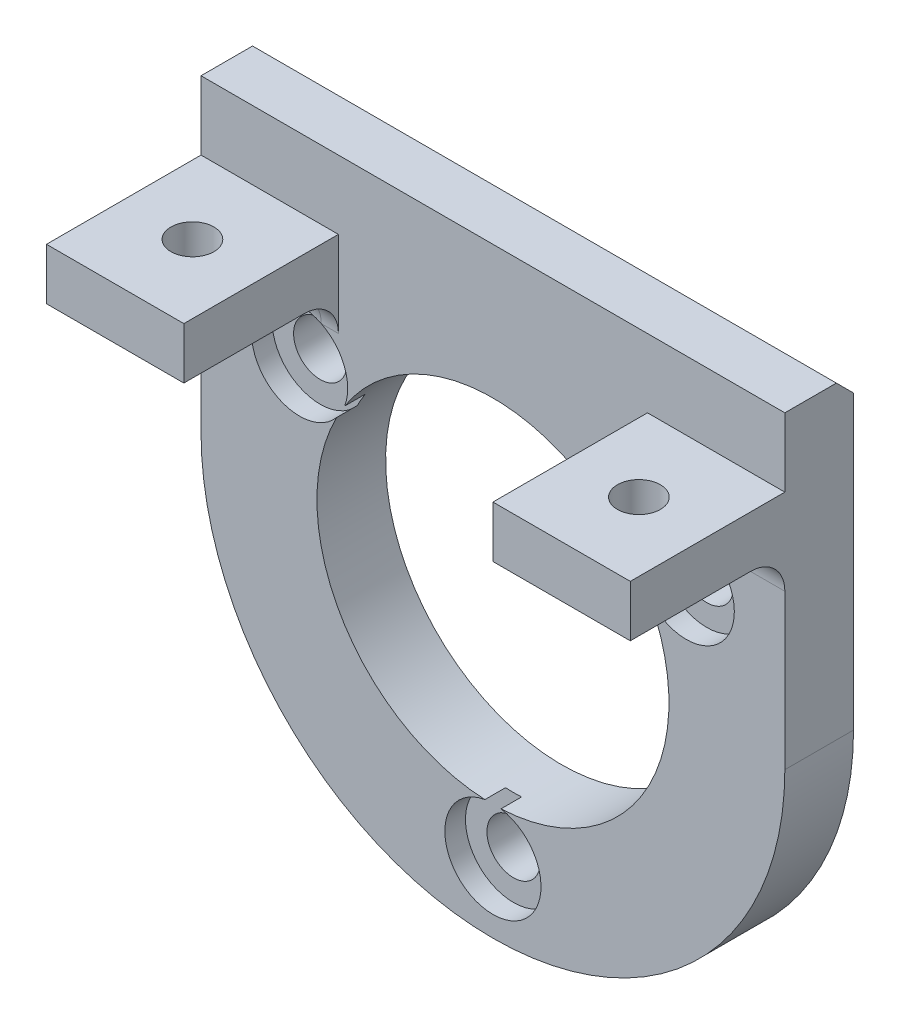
ISO-10303-21;
HEADER;
FILE_DESCRIPTION(('STEP AP214'),'2;1');
FILE_NAME('part.step','',(''),(''),'','','');
FILE_SCHEMA(('AUTOMOTIVE_DESIGN { 1 0 10303 214 1 1 1 1 }'));
ENDSEC;
DATA;
#1=APPLICATION_CONTEXT('core data for automotive mechanical design processes');
#2=APPLICATION_PROTOCOL_DEFINITION('international standard','automotive_design',2000,#1);
#3=PRODUCT_CONTEXT('',#1,'mechanical');
#4=PRODUCT('Part','Part','',(#3));
#5=PRODUCT_RELATED_PRODUCT_CATEGORY('part','',(#4));
#6=PRODUCT_DEFINITION_FORMATION('','',#4);
#7=PRODUCT_DEFINITION_CONTEXT('part definition',#1,'design');
#8=PRODUCT_DEFINITION('design','',#6,#7);
#9=PRODUCT_DEFINITION_SHAPE('','',#8);
#10=(LENGTH_UNIT() NAMED_UNIT(*) SI_UNIT(.MILLI.,.METRE.));
#11=(NAMED_UNIT(*) PLANE_ANGLE_UNIT() SI_UNIT($,.RADIAN.));
#12=(NAMED_UNIT(*) SI_UNIT($,.STERADIAN.) SOLID_ANGLE_UNIT());
#13=UNCERTAINTY_MEASURE_WITH_UNIT(LENGTH_MEASURE(1.E-05),#10,'distance_accuracy_value','');
#14=(GEOMETRIC_REPRESENTATION_CONTEXT(3) GLOBAL_UNCERTAINTY_ASSIGNED_CONTEXT((#13)) GLOBAL_UNIT_ASSIGNED_CONTEXT((#10,
#11,#12)) REPRESENTATION_CONTEXT('',''));
#15=CARTESIAN_POINT('',(0.,0.,0.));
#16=DIRECTION('',(0.,0.,1.));
#17=DIRECTION('',(1.,0.,0.));
#18=AXIS2_PLACEMENT_3D('',#15,#16,#17);
#19=CARTESIAN_POINT('',(0.,0.,2.));
#20=DIRECTION('',(0.,0.,1.));
#21=DIRECTION('',(1.,0.,0.));
#22=AXIS2_PLACEMENT_3D('',#19,#20,#21);
#23=PLANE('',#22);
#24=DIRECTION('',(0.,-1.,0.));
#25=VECTOR('',#24,1.);
#26=CARTESIAN_POINT('',(17.,0.,2.));
#27=LINE('',#26,#25);
#28=CARTESIAN_POINT('',(17.,9.,2.));
#29=VERTEX_POINT('',#28);
#30=CARTESIAN_POINT('',(17.,0.,2.));
#31=VERTEX_POINT('',#30);
#32=EDGE_CURVE('E480',#29,#31,#27,.T.);
#33=ORIENTED_EDGE('',*,*,#32,.F.);
#34=DIRECTION('',(-1.,0.,0.));
#35=VECTOR('',#34,1.);
#36=CARTESIAN_POINT('',(9.00000000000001,9.,2.));
#37=LINE('',#36,#35);
#38=CARTESIAN_POINT('',(12.5192822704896,9.,2.));
#39=VERTEX_POINT('',#38);
#40=EDGE_CURVE('E325',#29,#39,#37,.T.);
#41=ORIENTED_EDGE('',*,*,#40,.T.);
#42=CARTESIAN_POINT('',(11.2583302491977,6.5,2.));
#43=DIRECTION('',(0.,0.,1.));
#44=DIRECTION('',(1.,0.,0.));
#45=AXIS2_PLACEMENT_3D('',#42,#43,#44);
#46=CIRCLE('',#45,2.8);
#47=CARTESIAN_POINT('',(9.10133562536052,4.71467812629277,2.));
#48=VERTEX_POINT('',#47);
#49=EDGE_CURVE('E246',#48,#39,#46,.T.);
#50=ORIENTED_EDGE('',*,*,#49,.F.);
#51=CARTESIAN_POINT('',(0.,0.,2.));
#52=DIRECTION('',(0.,0.,1.));
#53=DIRECTION('',(1.,0.,0.));
#54=AXIS2_PLACEMENT_3D('',#51,#52,#53);
#55=CIRCLE('',#54,10.25);
#56=CARTESIAN_POINT('',(0.467636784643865,-10.2393269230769,2.));
#57=VERTEX_POINT('',#56);
#58=EDGE_CURVE('E284',#57,#48,#55,.T.);
#59=ORIENTED_EDGE('',*,*,#58,.F.);
#60=CARTESIAN_POINT('',(0.,-13.,2.));
#61=DIRECTION('',(0.,0.,1.));
#62=DIRECTION('',(1.,0.,0.));
#63=AXIS2_PLACEMENT_3D('',#60,#61,#62);
#64=CIRCLE('',#63,2.8);
#65=CARTESIAN_POINT('',(-0.467636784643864,-10.2393269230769,2.));
#66=VERTEX_POINT('',#65);
#67=EDGE_CURVE('E233',#66,#57,#64,.T.);
#68=ORIENTED_EDGE('',*,*,#67,.F.);
#69=CARTESIAN_POINT('',(-9.10133562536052,4.71467812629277,2.));
#70=VERTEX_POINT('',#69);
#71=EDGE_CURVE('E280',#70,#66,#55,.T.);
#72=ORIENTED_EDGE('',*,*,#71,.F.);
#73=CARTESIAN_POINT('',(-11.2583302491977,6.5,2.));
#74=DIRECTION('',(0.,0.,1.));
#75=DIRECTION('',(1.,0.,0.));
#76=AXIS2_PLACEMENT_3D('',#73,#74,#75);
#77=CIRCLE('',#76,2.8);
#78=CARTESIAN_POINT('',(-12.5192822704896,9.,2.));
#79=VERTEX_POINT('',#78);
#80=EDGE_CURVE('E259',#79,#70,#77,.T.);
#81=ORIENTED_EDGE('',*,*,#80,.F.);
#82=DIRECTION('',(1.,0.,0.));
#83=VECTOR('',#82,1.);
#84=CARTESIAN_POINT('',(0.,9.,2.));
#85=LINE('',#84,#83);
#86=CARTESIAN_POINT('',(-17.,9.,2.));
#87=VERTEX_POINT('',#86);
#88=EDGE_CURVE('E215',#79,#87,#85,.F.);
#89=ORIENTED_EDGE('',*,*,#88,.T.);
#90=DIRECTION('',(0.,1.,0.));
#91=VECTOR('',#90,1.);
#92=CARTESIAN_POINT('',(-17.,0.,2.));
#93=LINE('',#92,#91);
#94=CARTESIAN_POINT('',(-17.,0.,2.));
#95=VERTEX_POINT('',#94);
#96=EDGE_CURVE('E239',#95,#87,#93,.T.);
#97=ORIENTED_EDGE('',*,*,#96,.F.);
#98=CARTESIAN_POINT('',(0.,0.,2.));
#99=DIRECTION('',(0.,0.,1.));
#100=DIRECTION('',(1.,0.,0.));
#101=AXIS2_PLACEMENT_3D('',#98,#99,#100);
#102=CIRCLE('',#101,17.);
#103=EDGE_CURVE('E288',#95,#31,#102,.T.);
#104=ORIENTED_EDGE('',*,*,#103,.T.);
#105=EDGE_LOOP('',(#33,#41,#50,#59,#68,#72,#81,#89,#97,#104));
#106=FACE_BOUND('',#105,.T.);
#107=ADVANCED_FACE('F40',(#106),#23,.T.);
#108=CARTESIAN_POINT('',(0.,14.,2.));
#109=DIRECTION('',(0.,1.,0.));
#110=DIRECTION('',(0.,0.,1.));
#111=AXIS2_PLACEMENT_3D('',#108,#109,#110);
#112=PLANE('',#111);
#113=CARTESIAN_POINT('',(-13.,14.,6.5));
#114=DIRECTION('',(0.,1.,0.));
#115=DIRECTION('',(0.,0.,1.));
#116=AXIS2_PLACEMENT_3D('',#113,#114,#115);
#117=CIRCLE('',#116,1.24999999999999);
#118=CARTESIAN_POINT('',(-13.,14.,7.74999999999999));
#119=VERTEX_POINT('',#118);
#120=EDGE_CURVE('E318',#119,#119,#117,.T.);
#121=ORIENTED_EDGE('',*,*,#120,.F.);
#122=EDGE_LOOP('',(#121));
#123=FACE_BOUND('',#122,.T.);
#124=DIRECTION('',(1.,0.,0.));
#125=VECTOR('',#124,1.);
#126=CARTESIAN_POINT('',(0.,14.,2.));
#127=LINE('',#126,#125);
#128=CARTESIAN_POINT('',(-17.,14.,2.));
#129=VERTEX_POINT('',#128);
#130=CARTESIAN_POINT('',(-9.,14.,2.));
#131=VERTEX_POINT('',#130);
#132=EDGE_CURVE('E204',#129,#131,#127,.T.);
#133=ORIENTED_EDGE('',*,*,#132,.F.);
#134=DIRECTION('',(0.,0.,-1.));
#135=VECTOR('',#134,1.);
#136=CARTESIAN_POINT('',(-17.,14.,2.));
#137=LINE('',#136,#135);
#138=CARTESIAN_POINT('',(-17.,14.,11.));
#139=VERTEX_POINT('',#138);
#140=EDGE_CURVE('E209',#139,#129,#137,.T.);
#141=ORIENTED_EDGE('',*,*,#140,.F.);
#142=DIRECTION('',(1.,0.,0.));
#143=VECTOR('',#142,1.);
#144=CARTESIAN_POINT('',(0.,14.,11.));
#145=LINE('',#144,#143);
#146=CARTESIAN_POINT('',(-9.,14.,11.));
#147=VERTEX_POINT('',#146);
#148=EDGE_CURVE('E597',#139,#147,#145,.T.);
#149=ORIENTED_EDGE('',*,*,#148,.T.);
#150=DIRECTION('',(0.,0.,-1.));
#151=VECTOR('',#150,1.);
#152=CARTESIAN_POINT('',(-9.,14.,11.));
#153=LINE('',#152,#151);
#154=EDGE_CURVE('E212',#147,#131,#153,.T.);
#155=ORIENTED_EDGE('',*,*,#154,.T.);
#156=EDGE_LOOP('',(#133,#141,#149,#155));
#157=FACE_BOUND('',#156,.T.);
#158=ADVANCED_FACE('F206',(#123,#157),#112,.T.);
#159=CARTESIAN_POINT('',(0.,14.,2.));
#160=DIRECTION('',(0.,1.,0.));
#161=DIRECTION('',(0.,0.,1.));
#162=AXIS2_PLACEMENT_3D('',#159,#160,#161);
#163=PLANE('',#162);
#164=CARTESIAN_POINT('',(13.,14.,6.5));
#165=DIRECTION('',(0.,1.,0.));
#166=DIRECTION('',(0.,0.,1.));
#167=AXIS2_PLACEMENT_3D('',#164,#165,#166);
#168=CIRCLE('',#167,1.24999999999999);
#169=CARTESIAN_POINT('',(13.,14.,7.74999999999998));
#170=VERTEX_POINT('',#169);
#171=EDGE_CURVE('E317',#170,#170,#168,.T.);
#172=ORIENTED_EDGE('',*,*,#171,.F.);
#173=EDGE_LOOP('',(#172));
#174=FACE_BOUND('',#173,.T.);
#175=DIRECTION('',(0.,0.,-1.));
#176=VECTOR('',#175,1.);
#177=CARTESIAN_POINT('',(17.,14.,2.));
#178=LINE('',#177,#176);
#179=CARTESIAN_POINT('',(17.,14.,11.));
#180=VERTEX_POINT('',#179);
#181=CARTESIAN_POINT('',(17.,14.,2.));
#182=VERTEX_POINT('',#181);
#183=EDGE_CURVE('E609',#180,#182,#178,.T.);
#184=ORIENTED_EDGE('',*,*,#183,.T.);
#185=DIRECTION('',(1.,0.,0.));
#186=VECTOR('',#185,1.);
#187=CARTESIAN_POINT('',(0.,14.,2.));
#188=LINE('',#187,#186);
#189=CARTESIAN_POINT('',(9.,14.,2.));
#190=VERTEX_POINT('',#189);
#191=EDGE_CURVE('E565',#190,#182,#188,.T.);
#192=ORIENTED_EDGE('',*,*,#191,.F.);
#193=DIRECTION('',(0.,0.,-1.));
#194=VECTOR('',#193,1.);
#195=CARTESIAN_POINT('',(9.,14.,11.));
#196=LINE('',#195,#194);
#197=CARTESIAN_POINT('',(9.,14.,11.));
#198=VERTEX_POINT('',#197);
#199=EDGE_CURVE('E589',#198,#190,#196,.T.);
#200=ORIENTED_EDGE('',*,*,#199,.F.);
#201=DIRECTION('',(1.,0.,0.));
#202=VECTOR('',#201,1.);
#203=CARTESIAN_POINT('',(0.,14.,11.));
#204=LINE('',#203,#202);
#205=EDGE_CURVE('E567',#198,#180,#204,.T.);
#206=ORIENTED_EDGE('',*,*,#205,.T.);
#207=EDGE_LOOP('',(#184,#192,#200,#206));
#208=FACE_BOUND('',#207,.T.);
#209=ADVANCED_FACE('F428',(#174,#208),#163,.T.);
#210=CARTESIAN_POINT('',(0.,0.,2.));
#211=DIRECTION('',(0.,0.,-1.));
#212=DIRECTION('',(-1.,0.,0.));
#213=AXIS2_PLACEMENT_3D('',#210,#211,#212);
#214=CYLINDRICAL_SURFACE('',#213,17.);
#215=DIRECTION('',(0.,0.,-1.));
#216=VECTOR('',#215,1.);
#217=CARTESIAN_POINT('',(17.,0.,2.));
#218=LINE('',#217,#216);
#219=CARTESIAN_POINT('',(17.,0.,-2.));
#220=VERTEX_POINT('',#219);
#221=EDGE_CURVE('E539',#31,#220,#218,.T.);
#222=ORIENTED_EDGE('',*,*,#221,.F.);
#223=ORIENTED_EDGE('',*,*,#103,.F.);
#224=DIRECTION('',(0.,0.,-1.));
#225=VECTOR('',#224,1.);
#226=CARTESIAN_POINT('',(-17.,0.,2.));
#227=LINE('',#226,#225);
#228=CARTESIAN_POINT('',(-17.,0.,-2.));
#229=VERTEX_POINT('',#228);
#230=EDGE_CURVE('E234',#95,#229,#227,.T.);
#231=ORIENTED_EDGE('',*,*,#230,.T.);
#232=CARTESIAN_POINT('',(0.,0.,-2.));
#233=DIRECTION('',(0.,0.,1.));
#234=DIRECTION('',(1.,0.,0.));
#235=AXIS2_PLACEMENT_3D('',#232,#233,#234);
#236=CIRCLE('',#235,17.);
#237=EDGE_CURVE('E283',#229,#220,#236,.T.);
#238=ORIENTED_EDGE('',*,*,#237,.T.);
#239=EDGE_LOOP('',(#222,#223,#231,#238));
#240=FACE_BOUND('',#239,.T.);
#241=ADVANCED_FACE('F523',(#240),#214,.T.);
#242=CARTESIAN_POINT('',(0.,-13.,-2.));
#243=DIRECTION('',(0.,0.,1.));
#244=DIRECTION('',(1.,0.,0.));
#245=AXIS2_PLACEMENT_3D('',#242,#243,#244);
#246=CYLINDRICAL_SURFACE('',#245,1.55);
#247=CARTESIAN_POINT('',(0.,-13.,-2.));
#248=DIRECTION('',(0.,0.,1.));
#249=DIRECTION('',(1.,0.,0.));
#250=AXIS2_PLACEMENT_3D('',#247,#248,#249);
#251=CIRCLE('',#250,1.55);
#252=CARTESIAN_POINT('',(1.55,-13.,-2.));
#253=VERTEX_POINT('',#252);
#254=EDGE_CURVE('E270',#253,#253,#251,.T.);
#255=ORIENTED_EDGE('',*,*,#254,.F.);
#256=EDGE_LOOP('',(#255));
#257=FACE_BOUND('',#256,.T.);
#258=CARTESIAN_POINT('',(0.,-13.,0.8));
#259=DIRECTION('',(0.,0.,1.));
#260=DIRECTION('',(1.,0.,0.));
#261=AXIS2_PLACEMENT_3D('',#258,#259,#260);
#262=CIRCLE('',#261,1.55);
#263=CARTESIAN_POINT('',(1.55,-13.,0.8));
#264=VERTEX_POINT('',#263);
#265=EDGE_CURVE('E255',#264,#264,#262,.F.);
#266=ORIENTED_EDGE('',*,*,#265,.F.);
#267=EDGE_LOOP('',(#266));
#268=FACE_BOUND('',#267,.T.);
#269=ADVANCED_FACE('F450',(#257,#268),#246,.F.);
#270=CARTESIAN_POINT('',(11.2583302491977,6.5,-2.));
#271=DIRECTION('',(0.,0.,1.));
#272=DIRECTION('',(1.,0.,0.));
#273=AXIS2_PLACEMENT_3D('',#270,#271,#272);
#274=CYLINDRICAL_SURFACE('',#273,1.55);
#275=CARTESIAN_POINT('',(11.2583302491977,6.5,-2.));
#276=DIRECTION('',(0.,0.,1.));
#277=DIRECTION('',(1.,0.,0.));
#278=AXIS2_PLACEMENT_3D('',#275,#276,#277);
#279=CIRCLE('',#278,1.55);
#280=CARTESIAN_POINT('',(12.8083302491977,6.5,-2.));
#281=VERTEX_POINT('',#280);
#282=EDGE_CURVE('E271',#281,#281,#279,.T.);
#283=ORIENTED_EDGE('',*,*,#282,.F.);
#284=EDGE_LOOP('',(#283));
#285=FACE_BOUND('',#284,.T.);
#286=CARTESIAN_POINT('',(11.2583302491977,6.5,0.8));
#287=DIRECTION('',(0.,0.,1.));
#288=DIRECTION('',(1.,0.,0.));
#289=AXIS2_PLACEMENT_3D('',#286,#287,#288);
#290=CIRCLE('',#289,1.55);
#291=CARTESIAN_POINT('',(12.8083302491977,6.5,0.8));
#292=VERTEX_POINT('',#291);
#293=EDGE_CURVE('E245',#292,#292,#290,.F.);
#294=ORIENTED_EDGE('',*,*,#293,.F.);
#295=EDGE_LOOP('',(#294));
#296=FACE_BOUND('',#295,.T.);
#297=ADVANCED_FACE('F444',(#285,#296),#274,.F.);
#298=CARTESIAN_POINT('',(-11.2583302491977,6.5,-2.));
#299=DIRECTION('',(0.,0.,1.));
#300=DIRECTION('',(1.,0.,0.));
#301=AXIS2_PLACEMENT_3D('',#298,#299,#300);
#302=CYLINDRICAL_SURFACE('',#301,1.55);
#303=CARTESIAN_POINT('',(-11.2583302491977,6.5,-2.));
#304=DIRECTION('',(0.,0.,1.));
#305=DIRECTION('',(1.,0.,0.));
#306=AXIS2_PLACEMENT_3D('',#303,#304,#305);
#307=CIRCLE('',#306,1.55);
#308=CARTESIAN_POINT('',(-9.7083302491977,6.5,-2.));
#309=VERTEX_POINT('',#308);
#310=EDGE_CURVE('E274',#309,#309,#307,.T.);
#311=ORIENTED_EDGE('',*,*,#310,.F.);
#312=EDGE_LOOP('',(#311));
#313=FACE_BOUND('',#312,.T.);
#314=CARTESIAN_POINT('',(-11.2583302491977,6.5,0.8));
#315=DIRECTION('',(0.,0.,1.));
#316=DIRECTION('',(1.,0.,0.));
#317=AXIS2_PLACEMENT_3D('',#314,#315,#316);
#318=CIRCLE('',#317,1.55);
#319=CARTESIAN_POINT('',(-9.7083302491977,6.5,0.8));
#320=VERTEX_POINT('',#319);
#321=EDGE_CURVE('E262',#320,#320,#318,.F.);
#322=ORIENTED_EDGE('',*,*,#321,.F.);
#323=EDGE_LOOP('',(#322));
#324=FACE_BOUND('',#323,.T.);
#325=ADVANCED_FACE('F437',(#313,#324),#302,.F.);
#326=CARTESIAN_POINT('',(9.99737822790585,9.,2.));
#327=VERTEX_POINT('',#326);
#328=CARTESIAN_POINT('',(8.63369884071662,5.52464879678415,2.));
#329=VERTEX_POINT('',#328);
#330=EDGE_CURVE('E250',#327,#329,#46,.T.);
#331=ORIENTED_EDGE('',*,*,#330,.F.);
#332=DIRECTION('',(-1.,0.,0.));
#333=VECTOR('',#332,1.);
#334=CARTESIAN_POINT('',(9.00000000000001,9.,2.));
#335=LINE('',#334,#333);
#336=CARTESIAN_POINT('',(9.00000000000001,9.,2.));
#337=VERTEX_POINT('',#336);
#338=EDGE_CURVE('E322',#327,#337,#335,.T.);
#339=ORIENTED_EDGE('',*,*,#338,.T.);
#340=DIRECTION('',(0.,1.,0.));
#341=VECTOR('',#340,1.);
#342=CARTESIAN_POINT('',(9.00000000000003,0.,2.));
#343=LINE('',#342,#341);
#344=EDGE_CURVE('E571',#337,#190,#343,.T.);
#345=ORIENTED_EDGE('',*,*,#344,.T.);
#346=ORIENTED_EDGE('',*,*,#191,.T.);
#347=DIRECTION('',(0.,1.,0.));
#348=VECTOR('',#347,1.);
#349=CARTESIAN_POINT('',(17.,14.,2.));
#350=LINE('',#349,#348);
#351=CARTESIAN_POINT('',(17.,18.,2.));
#352=VERTEX_POINT('',#351);
#353=EDGE_CURVE('E226',#182,#352,#350,.T.);
#354=ORIENTED_EDGE('',*,*,#353,.T.);
#355=DIRECTION('',(-1.,0.,0.));
#356=VECTOR('',#355,1.);
#357=CARTESIAN_POINT('',(-17.,18.,2.));
#358=LINE('',#357,#356);
#359=CARTESIAN_POINT('',(-17.,18.,2.));
#360=VERTEX_POINT('',#359);
#361=EDGE_CURVE('E224',#352,#360,#358,.T.);
#362=ORIENTED_EDGE('',*,*,#361,.T.);
#363=DIRECTION('',(0.,-1.,0.));
#364=VECTOR('',#363,1.);
#365=CARTESIAN_POINT('',(-17.,14.,2.));
#366=LINE('',#365,#364);
#367=EDGE_CURVE('E220',#360,#129,#366,.T.);
#368=ORIENTED_EDGE('',*,*,#367,.T.);
#369=ORIENTED_EDGE('',*,*,#132,.T.);
#370=DIRECTION('',(0.,1.,0.));
#371=VECTOR('',#370,1.);
#372=CARTESIAN_POINT('',(-9.00000000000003,0.,2.));
#373=LINE('',#372,#371);
#374=CARTESIAN_POINT('',(-9.00000000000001,9.,2.));
#375=VERTEX_POINT('',#374);
#376=EDGE_CURVE('E591',#375,#131,#373,.T.);
#377=ORIENTED_EDGE('',*,*,#376,.F.);
#378=DIRECTION('',(1.,0.,0.));
#379=VECTOR('',#378,1.);
#380=CARTESIAN_POINT('',(0.,9.,2.));
#381=LINE('',#380,#379);
#382=CARTESIAN_POINT('',(-9.99737822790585,9.,2.));
#383=VERTEX_POINT('',#382);
#384=EDGE_CURVE('E320',#375,#383,#381,.F.);
#385=ORIENTED_EDGE('',*,*,#384,.T.);
#386=CARTESIAN_POINT('',(-8.63369884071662,5.52464879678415,2.));
#387=VERTEX_POINT('',#386);
#388=EDGE_CURVE('E263',#387,#383,#77,.T.);
#389=ORIENTED_EDGE('',*,*,#388,.F.);
#390=EDGE_CURVE('E285',#329,#387,#55,.T.);
#391=ORIENTED_EDGE('',*,*,#390,.F.);
#392=EDGE_LOOP('',(#331,#339,#345,#346,#354,#362,#368,#369,#377,#385,#389,#391));
#393=FACE_BOUND('',#392,.T.);
#394=ADVANCED_FACE('F221',(#393),#23,.T.);
#395=CARTESIAN_POINT('',(0.,0.,-2.));
#396=DIRECTION('',(0.,0.,1.));
#397=DIRECTION('',(1.,0.,0.));
#398=AXIS2_PLACEMENT_3D('',#395,#396,#397);
#399=PLANE('',#398);
#400=ORIENTED_EDGE('',*,*,#282,.T.);
#401=EDGE_LOOP('',(#400));
#402=FACE_BOUND('',#401,.T.);
#403=ORIENTED_EDGE('',*,*,#254,.T.);
#404=EDGE_LOOP('',(#403));
#405=FACE_BOUND('',#404,.T.);
#406=ORIENTED_EDGE('',*,*,#310,.T.);
#407=EDGE_LOOP('',(#406));
#408=FACE_BOUND('',#407,.T.);
#409=DIRECTION('',(0.,1.,0.));
#410=VECTOR('',#409,1.);
#411=CARTESIAN_POINT('',(-17.,0.,-2.));
#412=LINE('',#411,#410);
#413=CARTESIAN_POINT('',(-17.,17.,-2.));
#414=VERTEX_POINT('',#413);
#415=EDGE_CURVE('E536',#229,#414,#412,.T.);
#416=ORIENTED_EDGE('',*,*,#415,.T.);
#417=DIRECTION('',(1.,0.,0.));
#418=VECTOR('',#417,1.);
#419=CARTESIAN_POINT('',(17.,17.,-2.));
#420=LINE('',#419,#418);
#421=CARTESIAN_POINT('',(17.,17.,-2.));
#422=VERTEX_POINT('',#421);
#423=EDGE_CURVE('E412',#414,#422,#420,.T.);
#424=ORIENTED_EDGE('',*,*,#423,.T.);
#425=DIRECTION('',(0.,-1.,0.));
#426=VECTOR('',#425,1.);
#427=CARTESIAN_POINT('',(17.,0.,-2.));
#428=LINE('',#427,#426);
#429=EDGE_CURVE('E607',#422,#220,#428,.T.);
#430=ORIENTED_EDGE('',*,*,#429,.T.);
#431=ORIENTED_EDGE('',*,*,#237,.F.);
#432=EDGE_LOOP('',(#416,#424,#430,#431));
#433=FACE_BOUND('',#432,.T.);
#434=CARTESIAN_POINT('',(0.,0.,-2.));
#435=DIRECTION('',(0.,0.,1.));
#436=DIRECTION('',(1.,0.,0.));
#437=AXIS2_PLACEMENT_3D('',#434,#435,#436);
#438=CIRCLE('',#437,10.25);
#439=CARTESIAN_POINT('',(10.25,0.,-2.));
#440=VERTEX_POINT('',#439);
#441=EDGE_CURVE('E279',#440,#440,#438,.T.);
#442=ORIENTED_EDGE('',*,*,#441,.T.);
#443=EDGE_LOOP('',(#442));
#444=FACE_BOUND('',#443,.T.);
#445=ADVANCED_FACE('F436',(#402,#405,#408,#433,#444),#399,.F.);
#446=CARTESIAN_POINT('',(0.,0.,2.));
#447=DIRECTION('',(0.,0.,-1.));
#448=DIRECTION('',(-1.,0.,0.));
#449=AXIS2_PLACEMENT_3D('',#446,#447,#448);
#450=CYLINDRICAL_SURFACE('',#449,10.25);
#451=DIRECTION('',(0.,0.,1.));
#452=VECTOR('',#451,1.);
#453=CARTESIAN_POINT('',(9.1013356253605,4.71467812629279,1.4));
#454=LINE('',#453,#452);
#455=CARTESIAN_POINT('',(9.10133562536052,4.71467812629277,0.8));
#456=VERTEX_POINT('',#455);
#457=EDGE_CURVE('E216',#456,#48,#454,.T.);
#458=ORIENTED_EDGE('',*,*,#457,.F.);
#459=CARTESIAN_POINT('',(0.,0.,0.8));
#460=DIRECTION('',(0.,0.,1.));
#461=DIRECTION('',(1.,0.,0.));
#462=AXIS2_PLACEMENT_3D('',#459,#460,#461);
#463=CIRCLE('',#462,10.25);
#464=CARTESIAN_POINT('',(8.63369884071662,5.52464879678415,0.8));
#465=VERTEX_POINT('',#464);
#466=EDGE_CURVE('E252',#456,#465,#463,.T.);
#467=ORIENTED_EDGE('',*,*,#466,.T.);
#468=DIRECTION('',(0.,0.,1.));
#469=VECTOR('',#468,1.);
#470=CARTESIAN_POINT('',(8.63369884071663,5.52464879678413,1.4));
#471=LINE('',#470,#469);
#472=EDGE_CURVE('E310',#329,#465,#471,.F.);
#473=ORIENTED_EDGE('',*,*,#472,.F.);
#474=ORIENTED_EDGE('',*,*,#390,.T.);
#475=DIRECTION('',(0.,0.,1.));
#476=VECTOR('',#475,1.);
#477=CARTESIAN_POINT('',(-8.63369884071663,5.52464879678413,1.4));
#478=LINE('',#477,#476);
#479=CARTESIAN_POINT('',(-8.63369884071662,5.52464879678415,0.8));
#480=VERTEX_POINT('',#479);
#481=EDGE_CURVE('E298',#480,#387,#478,.T.);
#482=ORIENTED_EDGE('',*,*,#481,.F.);
#483=CARTESIAN_POINT('',(0.,0.,0.8));
#484=DIRECTION('',(0.,0.,1.));
#485=DIRECTION('',(1.,0.,0.));
#486=AXIS2_PLACEMENT_3D('',#483,#484,#485);
#487=CIRCLE('',#486,10.25);
#488=CARTESIAN_POINT('',(-9.10133562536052,4.71467812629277,0.8));
#489=VERTEX_POINT('',#488);
#490=EDGE_CURVE('E267',#480,#489,#487,.T.);
#491=ORIENTED_EDGE('',*,*,#490,.T.);
#492=DIRECTION('',(0.,0.,1.));
#493=VECTOR('',#492,1.);
#494=CARTESIAN_POINT('',(-9.1013356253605,4.71467812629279,1.4));
#495=LINE('',#494,#493);
#496=EDGE_CURVE('E291',#70,#489,#495,.F.);
#497=ORIENTED_EDGE('',*,*,#496,.F.);
#498=ORIENTED_EDGE('',*,*,#71,.T.);
#499=DIRECTION('',(0.,0.,1.));
#500=VECTOR('',#499,1.);
#501=CARTESIAN_POINT('',(-0.467636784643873,-10.2393269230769,1.4));
#502=LINE('',#501,#500);
#503=CARTESIAN_POINT('',(-0.467636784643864,-10.2393269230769,0.8));
#504=VERTEX_POINT('',#503);
#505=EDGE_CURVE('E308',#504,#66,#502,.T.);
#506=ORIENTED_EDGE('',*,*,#505,.F.);
#507=CARTESIAN_POINT('',(0.,0.,0.8));
#508=DIRECTION('',(0.,0.,1.));
#509=DIRECTION('',(1.,0.,0.));
#510=AXIS2_PLACEMENT_3D('',#507,#508,#509);
#511=CIRCLE('',#510,10.25);
#512=CARTESIAN_POINT('',(0.467636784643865,-10.2393269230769,0.8));
#513=VERTEX_POINT('',#512);
#514=EDGE_CURVE('E256',#504,#513,#511,.T.);
#515=ORIENTED_EDGE('',*,*,#514,.T.);
#516=DIRECTION('',(0.,0.,1.));
#517=VECTOR('',#516,1.);
#518=CARTESIAN_POINT('',(0.467636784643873,-10.2393269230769,1.4));
#519=LINE('',#518,#517);
#520=EDGE_CURVE('E301',#57,#513,#519,.F.);
#521=ORIENTED_EDGE('',*,*,#520,.F.);
#522=ORIENTED_EDGE('',*,*,#58,.T.);
#523=EDGE_LOOP('',(#458,#467,#473,#474,#482,#491,#497,#498,#506,#515,#521,#522));
#524=FACE_BOUND('',#523,.T.);
#525=ORIENTED_EDGE('',*,*,#441,.F.);
#526=EDGE_LOOP('',(#525));
#527=FACE_BOUND('',#526,.T.);
#528=ADVANCED_FACE('F442',(#524,#527),#450,.F.);
#529=CARTESIAN_POINT('',(-11.2583302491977,6.5,0.8));
#530=DIRECTION('',(0.,0.,1.));
#531=DIRECTION('',(1.,0.,0.));
#532=AXIS2_PLACEMENT_3D('',#529,#530,#531);
#533=PLANE('',#532);
#534=CARTESIAN_POINT('',(-11.2583302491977,6.5,0.8));
#535=DIRECTION('',(0.,0.,1.));
#536=DIRECTION('',(1.,0.,0.));
#537=AXIS2_PLACEMENT_3D('',#534,#535,#536);
#538=CIRCLE('',#537,2.8);
#539=EDGE_CURVE('E260',#480,#489,#538,.T.);
#540=ORIENTED_EDGE('',*,*,#539,.T.);
#541=ORIENTED_EDGE('',*,*,#490,.F.);
#542=EDGE_LOOP('',(#540,#541));
#543=FACE_BOUND('',#542,.T.);
#544=ORIENTED_EDGE('',*,*,#321,.T.);
#545=EDGE_LOOP('',(#544));
#546=FACE_BOUND('',#545,.T.);
#547=ADVANCED_FACE('F457',(#543,#546),#533,.T.);
#548=CARTESIAN_POINT('',(-11.2583302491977,6.5,0.8));
#549=DIRECTION('',(0.,0.,1.));
#550=DIRECTION('',(1.,0.,0.));
#551=AXIS2_PLACEMENT_3D('',#548,#549,#550);
#552=CYLINDRICAL_SURFACE('',#551,2.8);
#553=ORIENTED_EDGE('',*,*,#481,.T.);
#554=ORIENTED_EDGE('',*,*,#388,.T.);
#555=EDGE_CURVE('E266',#383,#79,#77,.T.);
#556=ORIENTED_EDGE('',*,*,#555,.T.);
#557=ORIENTED_EDGE('',*,*,#80,.T.);
#558=ORIENTED_EDGE('',*,*,#496,.T.);
#559=ORIENTED_EDGE('',*,*,#539,.F.);
#560=EDGE_LOOP('',(#553,#554,#556,#557,#558,#559));
#561=FACE_BOUND('',#560,.T.);
#562=ADVANCED_FACE('F462',(#561),#552,.F.);
#563=CARTESIAN_POINT('',(11.2583302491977,6.5,0.8));
#564=DIRECTION('',(0.,0.,1.));
#565=DIRECTION('',(1.,0.,0.));
#566=AXIS2_PLACEMENT_3D('',#563,#564,#565);
#567=PLANE('',#566);
#568=CARTESIAN_POINT('',(11.2583302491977,6.5,0.8));
#569=DIRECTION('',(0.,0.,1.));
#570=DIRECTION('',(1.,0.,0.));
#571=AXIS2_PLACEMENT_3D('',#568,#569,#570);
#572=CIRCLE('',#571,2.8);
#573=EDGE_CURVE('E243',#456,#465,#572,.T.);
#574=ORIENTED_EDGE('',*,*,#573,.T.);
#575=ORIENTED_EDGE('',*,*,#466,.F.);
#576=EDGE_LOOP('',(#574,#575));
#577=FACE_BOUND('',#576,.T.);
#578=ORIENTED_EDGE('',*,*,#293,.T.);
#579=EDGE_LOOP('',(#578));
#580=FACE_BOUND('',#579,.T.);
#581=ADVANCED_FACE('F805',(#577,#580),#567,.T.);
#582=CARTESIAN_POINT('',(11.2583302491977,6.5,0.8));
#583=DIRECTION('',(0.,0.,1.));
#584=DIRECTION('',(1.,0.,0.));
#585=AXIS2_PLACEMENT_3D('',#582,#583,#584);
#586=CYLINDRICAL_SURFACE('',#585,2.8);
#587=ORIENTED_EDGE('',*,*,#457,.T.);
#588=ORIENTED_EDGE('',*,*,#49,.T.);
#589=EDGE_CURVE('E249',#39,#327,#46,.T.);
#590=ORIENTED_EDGE('',*,*,#589,.T.);
#591=ORIENTED_EDGE('',*,*,#330,.T.);
#592=ORIENTED_EDGE('',*,*,#472,.T.);
#593=ORIENTED_EDGE('',*,*,#573,.F.);
#594=EDGE_LOOP('',(#587,#588,#590,#591,#592,#593));
#595=FACE_BOUND('',#594,.T.);
#596=ADVANCED_FACE('F476',(#595),#586,.F.);
#597=CARTESIAN_POINT('',(0.,-13.,0.8));
#598=DIRECTION('',(0.,0.,1.));
#599=DIRECTION('',(1.,0.,0.));
#600=AXIS2_PLACEMENT_3D('',#597,#598,#599);
#601=PLANE('',#600);
#602=CARTESIAN_POINT('',(0.,-13.,0.8));
#603=DIRECTION('',(0.,0.,1.));
#604=DIRECTION('',(1.,0.,0.));
#605=AXIS2_PLACEMENT_3D('',#602,#603,#604);
#606=CIRCLE('',#605,2.8);
#607=EDGE_CURVE('E236',#504,#513,#606,.T.);
#608=ORIENTED_EDGE('',*,*,#607,.T.);
#609=ORIENTED_EDGE('',*,*,#514,.F.);
#610=EDGE_LOOP('',(#608,#609));
#611=FACE_BOUND('',#610,.T.);
#612=ORIENTED_EDGE('',*,*,#265,.T.);
#613=EDGE_LOOP('',(#612));
#614=FACE_BOUND('',#613,.T.);
#615=ADVANCED_FACE('F516',(#611,#614),#601,.T.);
#616=CARTESIAN_POINT('',(0.,-13.,0.8));
#617=DIRECTION('',(0.,0.,1.));
#618=DIRECTION('',(1.,0.,0.));
#619=AXIS2_PLACEMENT_3D('',#616,#617,#618);
#620=CYLINDRICAL_SURFACE('',#619,2.8);
#621=ORIENTED_EDGE('',*,*,#505,.T.);
#622=ORIENTED_EDGE('',*,*,#67,.T.);
#623=ORIENTED_EDGE('',*,*,#520,.T.);
#624=ORIENTED_EDGE('',*,*,#607,.F.);
#625=EDGE_LOOP('',(#621,#622,#623,#624));
#626=FACE_BOUND('',#625,.T.);
#627=ADVANCED_FACE('F513',(#626),#620,.F.);
#628=CARTESIAN_POINT('',(-17.,0.,2.));
#629=DIRECTION('',(-1.,0.,0.));
#630=DIRECTION('',(0.,0.,1.));
#631=AXIS2_PLACEMENT_3D('',#628,#629,#630);
#632=PLANE('',#631);
#633=DIRECTION('',(0.,0.,1.));
#634=VECTOR('',#633,1.);
#635=CARTESIAN_POINT('',(-17.,18.,-36.2344855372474));
#636=LINE('',#635,#634);
#637=CARTESIAN_POINT('',(-17.,18.,-0.999999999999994));
#638=VERTEX_POINT('',#637);
#639=EDGE_CURVE('E563',#638,#360,#636,.T.);
#640=ORIENTED_EDGE('',*,*,#639,.F.);
#641=DIRECTION('',(0.,-0.707106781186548,-0.707106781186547));
#642=VECTOR('',#641,1.);
#643=CARTESIAN_POINT('',(-17.,10.5,-8.5));
#644=LINE('',#643,#642);
#645=EDGE_CURVE('E11',#638,#414,#644,.T.);
#646=ORIENTED_EDGE('',*,*,#645,.T.);
#647=ORIENTED_EDGE('',*,*,#415,.F.);
#648=ORIENTED_EDGE('',*,*,#230,.F.);
#649=ORIENTED_EDGE('',*,*,#96,.T.);
#650=CARTESIAN_POINT('',(-17.,9.,4.));
#651=DIRECTION('',(-1.,0.,0.));
#652=DIRECTION('',(0.,0.,1.));
#653=AXIS2_PLACEMENT_3D('',#650,#651,#652);
#654=CIRCLE('',#653,2.);
#655=CARTESIAN_POINT('',(-17.,11.,4.));
#656=VERTEX_POINT('',#655);
#657=EDGE_CURVE('E542',#87,#656,#654,.F.);
#658=ORIENTED_EDGE('',*,*,#657,.T.);
#659=DIRECTION('',(0.,0.,-1.));
#660=VECTOR('',#659,1.);
#661=CARTESIAN_POINT('',(-17.,11.,11.));
#662=LINE('',#661,#660);
#663=CARTESIAN_POINT('',(-17.,11.,11.));
#664=VERTEX_POINT('',#663);
#665=EDGE_CURVE('E600',#664,#656,#662,.T.);
#666=ORIENTED_EDGE('',*,*,#665,.F.);
#667=DIRECTION('',(0.,-1.,0.));
#668=VECTOR('',#667,1.);
#669=CARTESIAN_POINT('',(-17.,0.,11.));
#670=LINE('',#669,#668);
#671=EDGE_CURVE('E231',#139,#664,#670,.T.);
#672=ORIENTED_EDGE('',*,*,#671,.F.);
#673=ORIENTED_EDGE('',*,*,#140,.T.);
#674=ORIENTED_EDGE('',*,*,#367,.F.);
#675=EDGE_LOOP('',(#640,#646,#647,#648,#649,#658,#666,#672,#673,#674));
#676=FACE_BOUND('',#675,.T.);
#677=ADVANCED_FACE('F229',(#676),#632,.T.);
#678=CARTESIAN_POINT('',(17.,0.,2.));
#679=DIRECTION('',(1.,0.,0.));
#680=DIRECTION('',(0.,0.,-1.));
#681=AXIS2_PLACEMENT_3D('',#678,#679,#680);
#682=PLANE('',#681);
#683=ORIENTED_EDGE('',*,*,#429,.F.);
#684=DIRECTION('',(0.,0.707106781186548,0.707106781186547));
#685=VECTOR('',#684,1.);
#686=CARTESIAN_POINT('',(17.,10.5,-8.5));
#687=LINE('',#686,#685);
#688=CARTESIAN_POINT('',(17.,18.,-0.999999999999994));
#689=VERTEX_POINT('',#688);
#690=EDGE_CURVE('E62',#422,#689,#687,.T.);
#691=ORIENTED_EDGE('',*,*,#690,.T.);
#692=DIRECTION('',(0.,0.,1.));
#693=VECTOR('',#692,1.);
#694=CARTESIAN_POINT('',(17.,18.,-36.2344855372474));
#695=LINE('',#694,#693);
#696=EDGE_CURVE('E562',#689,#352,#695,.T.);
#697=ORIENTED_EDGE('',*,*,#696,.T.);
#698=ORIENTED_EDGE('',*,*,#353,.F.);
#699=ORIENTED_EDGE('',*,*,#183,.F.);
#700=DIRECTION('',(0.,1.,0.));
#701=VECTOR('',#700,1.);
#702=CARTESIAN_POINT('',(17.,0.,11.));
#703=LINE('',#702,#701);
#704=CARTESIAN_POINT('',(17.,11.,11.));
#705=VERTEX_POINT('',#704);
#706=EDGE_CURVE('E577',#705,#180,#703,.T.);
#707=ORIENTED_EDGE('',*,*,#706,.F.);
#708=DIRECTION('',(0.,0.,-1.));
#709=VECTOR('',#708,1.);
#710=CARTESIAN_POINT('',(17.,11.,11.));
#711=LINE('',#710,#709);
#712=CARTESIAN_POINT('',(17.,11.,4.));
#713=VERTEX_POINT('',#712);
#714=EDGE_CURVE('E580',#705,#713,#711,.T.);
#715=ORIENTED_EDGE('',*,*,#714,.T.);
#716=CARTESIAN_POINT('',(17.,9.,4.));
#717=DIRECTION('',(1.,0.,0.));
#718=DIRECTION('',(0.,0.,-1.));
#719=AXIS2_PLACEMENT_3D('',#716,#717,#718);
#720=CIRCLE('',#719,2.);
#721=EDGE_CURVE('E483',#713,#29,#720,.F.);
#722=ORIENTED_EDGE('',*,*,#721,.T.);
#723=ORIENTED_EDGE('',*,*,#32,.T.);
#724=ORIENTED_EDGE('',*,*,#221,.T.);
#725=EDGE_LOOP('',(#683,#691,#697,#698,#699,#707,#715,#722,#723,#724));
#726=FACE_BOUND('',#725,.T.);
#727=ADVANCED_FACE('F628',(#726),#682,.T.);
#728=CARTESIAN_POINT('',(0.,11.,11.));
#729=DIRECTION('',(0.,1.,0.));
#730=DIRECTION('',(-1.,0.,0.));
#731=AXIS2_PLACEMENT_3D('',#728,#729,#730);
#732=PLANE('',#731);
#733=CARTESIAN_POINT('',(-13.,11.,6.5));
#734=DIRECTION('',(0.,1.,0.));
#735=DIRECTION('',(-1.,0.,0.));
#736=AXIS2_PLACEMENT_3D('',#733,#734,#735);
#737=CIRCLE('',#736,1.24999999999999);
#738=CARTESIAN_POINT('',(-14.25,11.,6.5));
#739=VERTEX_POINT('',#738);
#740=EDGE_CURVE('E314',#739,#739,#737,.T.);
#741=ORIENTED_EDGE('',*,*,#740,.T.);
#742=EDGE_LOOP('',(#741));
#743=FACE_BOUND('',#742,.T.);
#744=ORIENTED_EDGE('',*,*,#665,.T.);
#745=DIRECTION('',(1.,0.,0.));
#746=VECTOR('',#745,1.);
#747=CARTESIAN_POINT('',(0.,11.,4.));
#748=LINE('',#747,#746);
#749=CARTESIAN_POINT('',(-12.5192822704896,11.,4.));
#750=VERTEX_POINT('',#749);
#751=EDGE_CURVE('E618',#656,#750,#748,.T.);
#752=ORIENTED_EDGE('',*,*,#751,.T.);
#753=CARTESIAN_POINT('',(-13.9065479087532,11.,3.81419182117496));
#754=CARTESIAN_POINT('',(-13.0456234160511,11.,1.2627672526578));
#755=CARTESIAN_POINT('',(-13.2943870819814,8.42210108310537,2.));
#756=CARTESIAN_POINT('',(-13.8120421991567,11.,3.84610408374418));
#757=CARTESIAN_POINT('',(-13.0578968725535,11.,1.31421200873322));
#758=CARTESIAN_POINT('',(-13.2601604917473,8.45828101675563,2.));
#759=CARTESIAN_POINT('',(-13.7159897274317,11.,3.87294758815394));
#760=CARTESIAN_POINT('',(-13.0588198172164,11.,1.36982382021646));
#761=CARTESIAN_POINT('',(-13.2224464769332,8.49636467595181,2.));
#762=CARTESIAN_POINT('',(-13.5221474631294,11.,3.91775384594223));
#763=CARTESIAN_POINT('',(-13.0378849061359,11.,1.48293674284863));
#764=CARTESIAN_POINT('',(-13.1389849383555,8.57521193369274,2.));
#765=CARTESIAN_POINT('',(-13.4243644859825,11.,3.93574574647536));
#766=CARTESIAN_POINT('',(-13.0166790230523,11.,1.54032824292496));
#767=CARTESIAN_POINT('',(-13.093264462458,8.61596622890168,2.));
#768=CARTESIAN_POINT('',(-13.2287404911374,11.,3.96415952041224));
#769=CARTESIAN_POINT('',(-12.9532321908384,11.,1.65218064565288));
#770=CARTESIAN_POINT('',(-12.9930138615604,8.69887206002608,2.));
#771=CARTESIAN_POINT('',(-13.1309094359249,11.,3.97465386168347));
#772=CARTESIAN_POINT('',(-12.9117216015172,11.,1.70670154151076));
#773=CARTESIAN_POINT('',(-12.9385744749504,8.74100598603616,2.));
#774=CARTESIAN_POINT('',(-12.9347427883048,11.,3.98987680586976));
#775=CARTESIAN_POINT('',(-12.8101086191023,11.,1.81028959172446));
#776=CARTESIAN_POINT('',(-12.8194364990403,8.82557337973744,2.));
#777=CARTESIAN_POINT('',(-12.8364068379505,11.,3.99460050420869));
#778=CARTESIAN_POINT('',(-12.7503848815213,11.,1.85951635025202));
#779=CARTESIAN_POINT('',(-12.7547292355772,8.86800707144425,2.));
#780=CARTESIAN_POINT('',(-12.6289192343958,11.,4.00016210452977));
#781=CARTESIAN_POINT('',(-12.6078133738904,11.,1.95517226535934));
#782=CARTESIAN_POINT('',(-12.6066202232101,8.95566602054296,2.));
#783=CARTESIAN_POINT('',(-12.5197575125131,11.,4.00052009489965));
#784=CARTESIAN_POINT('',(-12.5232644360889,11.,2.00114098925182));
#785=CARTESIAN_POINT('',(-12.5219493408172,9.00069109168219,2.));
#786=CARTESIAN_POINT('',(-12.301494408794,11.,3.99836477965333));
#787=CARTESIAN_POINT('',(-12.3385985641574,11.,2.08197219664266));
#788=CARTESIAN_POINT('',(-12.3388364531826,9.08508088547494,2.));
#789=CARTESIAN_POINT('',(-12.1923930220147,11.,3.99585176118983));
#790=CARTESIAN_POINT('',(-12.2384891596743,11.,2.11719606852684));
#791=CARTESIAN_POINT('',(-12.2403958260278,9.12444617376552,2.));
#792=CARTESIAN_POINT('',(-11.9736812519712,11.,3.99009815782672));
#793=CARTESIAN_POINT('',(-12.0264913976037,11.,2.17596959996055));
#794=CARTESIAN_POINT('',(-12.0306161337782,9.19365978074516,2.));
#795=CARTESIAN_POINT('',(-11.8640709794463,11.,3.98685408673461));
#796=CARTESIAN_POINT('',(-11.9142054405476,11.,2.1997946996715));
#797=CARTESIAN_POINT('',(-11.91921654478,9.2234607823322,2.));
#798=CARTESIAN_POINT('',(-11.6448413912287,11.,3.98145782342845));
#799=CARTESIAN_POINT('',(-11.6829721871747,11.,2.23535899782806));
#800=CARTESIAN_POINT('',(-11.6875085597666,9.2694218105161,2.));
#801=CARTESIAN_POINT('',(-11.5352220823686,11.,3.97930540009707));
#802=CARTESIAN_POINT('',(-11.5633819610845,11.,2.24733278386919));
#803=CARTESIAN_POINT('',(-11.5672020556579,9.28558472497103,2.));
#804=CARTESIAN_POINT('',(-11.3452599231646,11.,3.97741057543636));
#805=CARTESIAN_POINT('',(-11.3545915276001,11.,2.25773459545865));
#806=CARTESIAN_POINT('',(-11.3558812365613,9.29974047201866,2.));
#807=CARTESIAN_POINT('',(-11.2649224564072,11.,3.97717781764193));
#808=CARTESIAN_POINT('',(-11.2654970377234,11.,2.25896573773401));
#809=CARTESIAN_POINT('',(-11.2656314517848,9.30143493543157,2.));
#810=CARTESIAN_POINT('',(-11.104254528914,11.,3.97789549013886));
#811=CARTESIAN_POINT('',(-11.0882424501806,11.,2.25508998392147));
#812=CARTESIAN_POINT('',(-11.0859193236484,9.29613049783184,2.));
#813=CARTESIAN_POINT('',(-11.0239240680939,11.,3.97884590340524));
#814=CARTESIAN_POINT('',(-10.9997477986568,11.,2.2499685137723));
#815=CARTESIAN_POINT('',(-10.9964569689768,9.28913172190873,2.));
#816=CARTESIAN_POINT('',(-10.863264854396,11.,3.98168480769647));
#817=CARTESIAN_POINT('',(-10.8255494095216,11.,2.23343080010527));
#818=CARTESIAN_POINT('',(-10.8207167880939,9.26701067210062,2.));
#819=CARTESIAN_POINT('',(-10.782936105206,11.,3.98357348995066));
#820=CARTESIAN_POINT('',(-10.7395448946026,11.,2.22195261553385));
#821=CARTESIAN_POINT('',(-10.7344396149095,9.25188674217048,2.));
#822=CARTESIAN_POINT('',(-10.6222842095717,11.,3.98776819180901));
#823=CARTESIAN_POINT('',(-10.5720985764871,11.,2.19276622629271));
#824=CARTESIAN_POINT('',(-10.5670674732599,9.21468459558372,2.));
#825=CARTESIAN_POINT('',(-10.5419610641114,11.,3.99007424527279));
#826=CARTESIAN_POINT('',(-10.4904238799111,11.,2.17495779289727));
#827=CARTESIAN_POINT('',(-10.4859729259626,9.19260581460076,2.));
#828=CARTESIAN_POINT('',(-10.3814477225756,11.,3.99438194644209));
#829=CARTESIAN_POINT('',(-10.3334095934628,11.,2.13327572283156));
#830=CARTESIAN_POINT('',(-10.3304771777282,9.1430557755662,2.));
#831=CARTESIAN_POINT('',(-10.3012575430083,11.,3.99638412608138));
#832=CARTESIAN_POINT('',(-10.2579146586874,11.,2.10928526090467));
#833=CARTESIAN_POINT('',(-10.2560643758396,9.11559413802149,2.));
#834=CARTESIAN_POINT('',(-10.1408706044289,11.,3.99925581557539));
#835=CARTESIAN_POINT('',(-10.1146087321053,11.,2.05548515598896));
#836=CARTESIAN_POINT('',(-10.1145101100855,9.05686319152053,2.));
#837=CARTESIAN_POINT('',(-10.0606738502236,11.,4.00012556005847));
#838=CARTESIAN_POINT('',(-10.0467508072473,11.,2.02553541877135));
#839=CARTESIAN_POINT('',(-10.0473671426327,9.02559467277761,2.));
#840=CARTESIAN_POINT('',(-9.90024987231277,11.,3.99984511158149));
#841=CARTESIAN_POINT('',(-9.92013875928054,11.,1.96024810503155));
#842=CARTESIAN_POINT('',(-9.92052813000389,8.9607663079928,2.));
#843=CARTESIAN_POINT('',(-9.82002264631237,11.,3.99869436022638));
#844=CARTESIAN_POINT('',(-9.86143867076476,11.,1.92476876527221));
#845=CARTESIAN_POINT('',(-9.86083414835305,8.92720583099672,2.));
#846=CARTESIAN_POINT('',(-9.65960730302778,11.,3.99347985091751));
#847=CARTESIAN_POINT('',(-9.75438982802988,11.,1.84917679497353));
#848=CARTESIAN_POINT('',(-9.74862821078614,8.85904520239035,2.));
#849=CARTESIAN_POINT('',(-9.57941926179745,11.,3.98941387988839));
#850=CARTESIAN_POINT('',(-9.70618504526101,11.,1.80893745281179));
#851=CARTESIAN_POINT('',(-9.69612174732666,8.82444428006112,2.));
#852=CARTESIAN_POINT('',(-9.49933561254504,11.,3.98344416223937));
#853=CARTESIAN_POINT('',(-9.66445019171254,11.,1.76727084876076));
#854=CARTESIAN_POINT('',(-9.6471108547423,8.78997206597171,2.));
#855=(BOUNDED_SURFACE() B_SPLINE_SURFACE(3,2,((#753,#754,#755),(#756,#757,#758),(#759,#760,
#761),(#762,#763,#764),(#765,#766,#767),(#768,#769,#770),(#771,#772,#773),(#774,#775,#776),
(#777,#778,#779),(#780,#781,#782),(#783,#784,#785),(#786,#787,#788),(#789,#790,#791),(#792,#793,
#794),(#795,#796,#797),(#798,#799,#800),(#801,#802,#803),(#804,#805,#806),(#807,#808,#809),
(#810,#811,#812),(#813,#814,#815),(#816,#817,#818),(#819,#820,#821),(#822,#823,#824),(#825,#826,
#827),(#828,#829,#830),(#831,#832,#833),(#834,#835,#836),(#837,#838,#839),(#840,#841,#842),
(#843,#844,#845),(#846,#847,#848),(#849,#850,#851),(#852,#853,#854)),.UNSPECIFIED.,.F.,.F.,
.F.) B_SPLINE_SURFACE_WITH_KNOTS((4,2,2,2,2,2,2,2,2,2,2,2,2,2,2,2,4),(3,3),(0.,
0.298880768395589,0.596770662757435,0.891740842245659,1.18696154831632,1.51437557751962,
1.84175686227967,2.17073367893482,2.49964081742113,2.74064499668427,2.98164570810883,
3.22269555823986,3.46376497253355,3.70440740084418,3.94499996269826,4.1856590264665,
4.42650097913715),(0.,1.),
.UNSPECIFIED.) GEOMETRIC_REPRESENTATION_ITEM() RATIONAL_B_SPLINE_SURFACE(((1.,0.596259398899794,
1.),(1.,0.603850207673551,1.),(1.,0.611683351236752,1.),(1.,0.627585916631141,1.),(1.,
0.635654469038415,1.),(1.,0.651753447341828,1.),(1.,0.659783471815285,1.),(1.,0.675615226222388,
1.),(1.,0.683416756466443,1.),(1.,0.699275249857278,1.),(1.,0.707267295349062,1.),(1.,
0.722028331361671,1.),(1.,0.728797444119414,1.),(1.,0.740574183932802,1.),(1.,0.745573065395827,
1.),(1.,0.753240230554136,1.),(1.,0.755909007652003,1.),(1.,0.758245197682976,1.),(1.,
0.758524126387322,1.),(1.,0.75764958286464,1.),(1.,0.756496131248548,1.),(1.,0.752831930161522,
1.),(1.,0.750320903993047,1.),(1.,0.74409726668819,1.),(1.,0.740384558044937,1.),(1.,
0.731970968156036,1.),(1.,0.72727184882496,1.),(1.,0.717106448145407,1.),(1.,0.711640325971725,
1.),(1.,0.700160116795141,1.),(1.,0.694145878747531,1.),(1.,0.681763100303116,1.),(1.,
0.675394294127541,1.),(1.,0.668949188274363,1.))) REPRESENTATION_ITEM('') SURFACE());
#856=CARTESIAN_POINT('',(-13.9065479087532,11.,3.81419182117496));
#857=CARTESIAN_POINT('',(-13.8120421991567,11.,3.84610408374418));
#858=CARTESIAN_POINT('',(-13.7159897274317,11.,3.87294758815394));
#859=CARTESIAN_POINT('',(-13.5221474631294,11.,3.91775384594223));
#860=CARTESIAN_POINT('',(-13.4243644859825,11.,3.93574574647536));
#861=CARTESIAN_POINT('',(-13.2287404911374,11.,3.96415952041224));
#862=CARTESIAN_POINT('',(-13.1309094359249,11.,3.97465386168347));
#863=CARTESIAN_POINT('',(-12.9347427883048,11.,3.98987680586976));
#864=CARTESIAN_POINT('',(-12.8364068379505,11.,3.99460050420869));
#865=CARTESIAN_POINT('',(-12.6289192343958,11.,4.00016210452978));
#866=CARTESIAN_POINT('',(-12.5197575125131,11.,4.00052009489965));
#867=CARTESIAN_POINT('',(-12.301494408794,11.,3.99836477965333));
#868=CARTESIAN_POINT('',(-12.1923930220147,11.,3.99585176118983));
#869=CARTESIAN_POINT('',(-11.9736812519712,11.,3.99009815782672));
#870=CARTESIAN_POINT('',(-11.8640709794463,11.,3.98685408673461));
#871=CARTESIAN_POINT('',(-11.6448413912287,11.,3.98145782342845));
#872=CARTESIAN_POINT('',(-11.5352220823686,11.,3.97930540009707));
#873=CARTESIAN_POINT('',(-11.3452599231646,11.,3.97741057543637));
#874=CARTESIAN_POINT('',(-11.2649224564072,11.,3.97717781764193));
#875=CARTESIAN_POINT('',(-11.104254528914,11.,3.97789549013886));
#876=CARTESIAN_POINT('',(-11.0239240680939,11.,3.97884590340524));
#877=CARTESIAN_POINT('',(-10.863264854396,11.,3.98168480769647));
#878=CARTESIAN_POINT('',(-10.782936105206,11.,3.98357348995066));
#879=CARTESIAN_POINT('',(-10.6222842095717,11.,3.98776819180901));
#880=CARTESIAN_POINT('',(-10.5419610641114,11.,3.99007424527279));
#881=CARTESIAN_POINT('',(-10.3814477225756,11.,3.99438194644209));
#882=CARTESIAN_POINT('',(-10.3012575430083,11.,3.99638412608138));
#883=CARTESIAN_POINT('',(-10.1408706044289,11.,3.99925581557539));
#884=CARTESIAN_POINT('',(-10.0606738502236,11.,4.00012556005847));
#885=CARTESIAN_POINT('',(-9.90024987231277,11.,3.99984511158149));
#886=CARTESIAN_POINT('',(-9.82002264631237,11.,3.99869436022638));
#887=CARTESIAN_POINT('',(-9.65960730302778,11.,3.99347985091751));
#888=CARTESIAN_POINT('',(-9.57941926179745,11.,3.98941387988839));
#889=CARTESIAN_POINT('',(-9.49933561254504,11.,3.98344416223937));
#890=B_SPLINE_CURVE_WITH_KNOTS('',3,(#856,#857,#858,#859,#860,#861,#862,#863,#864,#865,#866,
#867,#868,#869,#870,#871,#872,#873,#874,#875,#876,#877,#878,#879,#880,#881,#882,#883,#884,#885,
#886,#887,#888,#889),.UNSPECIFIED.,.F.,.F.,(4,2,2,2,2,2,2,2,2,2,2,2,2,2,2,2,4),(0.,
0.298880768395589,0.596770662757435,0.891740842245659,1.18696154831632,1.51437557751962,
1.84175686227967,2.17073367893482,2.49964081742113,2.74064499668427,2.98164570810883,
3.22269555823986,3.46376497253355,3.70440740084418,3.94499996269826,4.1856590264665,
4.42650097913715),.UNSPECIFIED.);
#891=CARTESIAN_POINT('',(-9.99737822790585,11.,4.));
#892=VERTEX_POINT('',#891);
#893=EDGE_CURVE('E621',#750,#892,#890,.T.);
#894=ORIENTED_EDGE('',*,*,#893,.T.);
#895=DIRECTION('',(1.,0.,0.));
#896=VECTOR('',#895,1.);
#897=CARTESIAN_POINT('',(0.,11.,4.));
#898=LINE('',#897,#896);
#899=CARTESIAN_POINT('',(-9.00000000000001,11.,4.));
#900=VERTEX_POINT('',#899);
#901=EDGE_CURVE('E506',#892,#900,#898,.T.);
#902=ORIENTED_EDGE('',*,*,#901,.T.);
#903=DIRECTION('',(0.,0.,-1.));
#904=VECTOR('',#903,1.);
#905=CARTESIAN_POINT('',(-9.00000000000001,11.,11.));
#906=LINE('',#905,#904);
#907=CARTESIAN_POINT('',(-9.00000000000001,11.,11.));
#908=VERTEX_POINT('',#907);
#909=EDGE_CURVE('E604',#908,#900,#906,.T.);
#910=ORIENTED_EDGE('',*,*,#909,.F.);
#911=DIRECTION('',(1.,0.,0.));
#912=VECTOR('',#911,1.);
#913=CARTESIAN_POINT('',(0.,11.,11.));
#914=LINE('',#913,#912);
#915=EDGE_CURVE('E592',#664,#908,#914,.T.);
#916=ORIENTED_EDGE('',*,*,#915,.F.);
#917=EDGE_LOOP('',(#744,#752,#894,#902,#910,#916));
#918=FACE_BOUND('',#917,.T.);
#919=ADVANCED_FACE('F401',(#743,#918),#732,.F.);
#920=CARTESIAN_POINT('',(-9.00000000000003,0.,11.));
#921=DIRECTION('',(-1.,0.,0.));
#922=DIRECTION('',(0.,-1.,0.));
#923=AXIS2_PLACEMENT_3D('',#920,#921,#922);
#924=PLANE('',#923);
#925=ORIENTED_EDGE('',*,*,#376,.T.);
#926=ORIENTED_EDGE('',*,*,#154,.F.);
#927=DIRECTION('',(0.,1.,0.));
#928=VECTOR('',#927,1.);
#929=CARTESIAN_POINT('',(-9.00000000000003,0.,11.));
#930=LINE('',#929,#928);
#931=EDGE_CURVE('E595',#908,#147,#930,.T.);
#932=ORIENTED_EDGE('',*,*,#931,.F.);
#933=ORIENTED_EDGE('',*,*,#909,.T.);
#934=CARTESIAN_POINT('',(-9.00000000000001,9.,4.));
#935=DIRECTION('',(-1.,0.,0.));
#936=DIRECTION('',(0.,-1.,0.));
#937=AXIS2_PLACEMENT_3D('',#934,#935,#936);
#938=CIRCLE('',#937,2.);
#939=EDGE_CURVE('E543',#900,#375,#938,.T.);
#940=ORIENTED_EDGE('',*,*,#939,.T.);
#941=EDGE_LOOP('',(#925,#926,#932,#933,#940));
#942=FACE_BOUND('',#941,.T.);
#943=ADVANCED_FACE('F661',(#942),#924,.F.);
#944=CARTESIAN_POINT('',(0.,0.,11.));
#945=DIRECTION('',(0.,0.,1.));
#946=DIRECTION('',(1.,0.,0.));
#947=AXIS2_PLACEMENT_3D('',#944,#945,#946);
#948=PLANE('',#947);
#949=ORIENTED_EDGE('',*,*,#915,.T.);
#950=ORIENTED_EDGE('',*,*,#931,.T.);
#951=ORIENTED_EDGE('',*,*,#148,.F.);
#952=ORIENTED_EDGE('',*,*,#671,.T.);
#953=EDGE_LOOP('',(#949,#950,#951,#952));
#954=FACE_BOUND('',#953,.T.);
#955=ADVANCED_FACE('F665',(#954),#948,.T.);
#956=CARTESIAN_POINT('',(9.00000000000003,0.,11.));
#957=DIRECTION('',(-1.,0.,0.));
#958=DIRECTION('',(0.,-1.,0.));
#959=AXIS2_PLACEMENT_3D('',#956,#957,#958);
#960=PLANE('',#959);
#961=ORIENTED_EDGE('',*,*,#344,.F.);
#962=CARTESIAN_POINT('',(9.00000000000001,9.,4.));
#963=DIRECTION('',(-1.,0.,0.));
#964=DIRECTION('',(0.,-1.,0.));
#965=AXIS2_PLACEMENT_3D('',#962,#963,#964);
#966=CIRCLE('',#965,2.);
#967=CARTESIAN_POINT('',(9.00000000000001,11.,4.));
#968=VERTEX_POINT('',#967);
#969=EDGE_CURVE('E620',#337,#968,#966,.F.);
#970=ORIENTED_EDGE('',*,*,#969,.T.);
#971=DIRECTION('',(0.,0.,-1.));
#972=VECTOR('',#971,1.);
#973=CARTESIAN_POINT('',(9.00000000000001,11.,11.));
#974=LINE('',#973,#972);
#975=CARTESIAN_POINT('',(9.00000000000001,11.,11.));
#976=VERTEX_POINT('',#975);
#977=EDGE_CURVE('E586',#976,#968,#974,.T.);
#978=ORIENTED_EDGE('',*,*,#977,.F.);
#979=DIRECTION('',(0.,1.,0.));
#980=VECTOR('',#979,1.);
#981=CARTESIAN_POINT('',(9.00000000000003,0.,11.));
#982=LINE('',#981,#980);
#983=EDGE_CURVE('E570',#976,#198,#982,.T.);
#984=ORIENTED_EDGE('',*,*,#983,.T.);
#985=ORIENTED_EDGE('',*,*,#199,.T.);
#986=EDGE_LOOP('',(#961,#970,#978,#984,#985));
#987=FACE_BOUND('',#986,.T.);
#988=ADVANCED_FACE('F349',(#987),#960,.T.);
#989=CARTESIAN_POINT('',(0.,11.,11.));
#990=DIRECTION('',(0.,-1.,0.));
#991=DIRECTION('',(1.,0.,0.));
#992=AXIS2_PLACEMENT_3D('',#989,#990,#991);
#993=PLANE('',#992);
#994=CARTESIAN_POINT('',(13.,11.,6.5));
#995=DIRECTION('',(0.,-1.,0.));
#996=DIRECTION('',(1.,0.,0.));
#997=AXIS2_PLACEMENT_3D('',#994,#995,#996);
#998=CIRCLE('',#997,1.24999999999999);
#999=CARTESIAN_POINT('',(14.25,11.,6.5));
#1000=VERTEX_POINT('',#999);
#1001=EDGE_CURVE('E227',#1000,#1000,#998,.T.);
#1002=ORIENTED_EDGE('',*,*,#1001,.F.);
#1003=EDGE_LOOP('',(#1002));
#1004=FACE_BOUND('',#1003,.T.);
#1005=ORIENTED_EDGE('',*,*,#977,.T.);
#1006=DIRECTION('',(-1.,0.,0.));
#1007=VECTOR('',#1006,1.);
#1008=CARTESIAN_POINT('',(17.,11.,4.));
#1009=LINE('',#1008,#1007);
#1010=CARTESIAN_POINT('',(9.99737822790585,11.,4.));
#1011=VERTEX_POINT('',#1010);
#1012=EDGE_CURVE('E337',#968,#1011,#1009,.F.);
#1013=ORIENTED_EDGE('',*,*,#1012,.T.);
#1014=CARTESIAN_POINT('',(8.61011258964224,11.,3.81419182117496));
#1015=CARTESIAN_POINT('',(9.47103710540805,11.,1.26276730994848));
#1016=CARTESIAN_POINT('',(9.2222734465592,8.42210111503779,2.));
#1017=CARTESIAN_POINT('',(8.70461829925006,11.,3.84610408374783));
#1018=CARTESIAN_POINT('',(9.45876363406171,11.,1.31421202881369));
#1019=CARTESIAN_POINT('',(9.25650001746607,8.45828102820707,2.));
#1020=CARTESIAN_POINT('',(8.80067077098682,11.,3.87294758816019));
#1021=CARTESIAN_POINT('',(9.45784068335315,11.,1.36982382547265));
#1022=CARTESIAN_POINT('',(9.29421402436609,8.49636467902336,2.));
#1023=CARTESIAN_POINT('',(8.99451303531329,11.,3.91775384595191));
#1024=CARTESIAN_POINT('',(9.47877559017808,11.,1.48293673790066));
#1025=CARTESIAN_POINT('',(9.37767555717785,8.57521193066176,2.));
#1026=CARTESIAN_POINT('',(9.09229601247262,11.,3.93574574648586));
#1027=CARTESIAN_POINT('',(9.49998147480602,11.,1.54032824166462));
#1028=CARTESIAN_POINT('',(9.42339603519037,8.61596622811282,2.));
#1029=CARTESIAN_POINT('',(9.28792000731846,11.,3.96415952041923));
#1030=CARTESIAN_POINT('',(9.56342830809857,11.,1.65218064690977));
#1031=CARTESIAN_POINT('',(9.52364663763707,8.69887206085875,2.));
#1032=CARTESIAN_POINT('',(9.38575106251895,11.,3.97465386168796));
#1033=CARTESIAN_POINT('',(9.60493889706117,11.,1.70670154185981));
#1034=CARTESIAN_POINT('',(9.57808602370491,8.74100598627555,2.));
#1035=CARTESIAN_POINT('',(9.58191771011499,11.,3.98987680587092));
#1036=CARTESIAN_POINT('',(9.70655187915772,11.,1.81028959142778));
#1037=CARTESIAN_POINT('',(9.69722399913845,8.82557337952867,2.));
#1038=CARTESIAN_POINT('',(9.68025366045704,11.,3.99460050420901));
#1039=CARTESIAN_POINT('',(9.76627561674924,11.,1.85951635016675));
#1040=CARTESIAN_POINT('',(9.76193126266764,8.86800707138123,2.));
#1041=CARTESIAN_POINT('',(9.88774126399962,11.,4.00016210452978));
#1042=CARTESIAN_POINT('',(9.90884712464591,11.,1.95517226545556));
#1043=CARTESIAN_POINT('',(9.91004027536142,8.95566602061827,2.));
#1044=CARTESIAN_POINT('',(9.99690298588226,11.,4.00052009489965));
#1045=CARTESIAN_POINT('',(9.99339606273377,11.,2.00114098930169));
#1046=CARTESIAN_POINT('',(9.99471115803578,9.00069109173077,2.));
#1047=CARTESIAN_POINT('',(10.2151660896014,11.,3.99836477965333));
#1048=CARTESIAN_POINT('',(10.1780619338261,11.,2.08197219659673));
#1049=CARTESIAN_POINT('',(10.1778240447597,9.08508088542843,2.));
#1050=CARTESIAN_POINT('',(10.3242674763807,11.,3.99585176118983));
#1051=CARTESIAN_POINT('',(10.2781713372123,11.,2.11719606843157));
#1052=CARTESIAN_POINT('',(10.2762646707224,9.12444617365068,2.));
#1053=CARTESIAN_POINT('',(10.5429792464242,11.,3.99009815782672));
#1054=CARTESIAN_POINT('',(10.490169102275,11.,2.17596960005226));
#1055=CARTESIAN_POINT('',(10.4860443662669,9.1936597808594,2.));
#1056=CARTESIAN_POINT('',(10.6525895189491,11.,3.98685408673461));
#1057=CARTESIAN_POINT('',(10.6024550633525,11.,2.1997946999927));
#1058=CARTESIAN_POINT('',(10.5974439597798,9.22346078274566,2.));
#1059=CARTESIAN_POINT('',(10.8718191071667,11.,3.98145782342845));
#1060=CARTESIAN_POINT('',(10.8336883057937,11.,2.23535899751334));
#1061=CARTESIAN_POINT('',(10.8291519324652,9.26942181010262,2.));
#1062=CARTESIAN_POINT('',(10.9814384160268,11.,3.97930540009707));
#1063=CARTESIAN_POINT('',(10.953278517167,11.,2.2473327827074));
#1064=CARTESIAN_POINT('',(10.9494584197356,9.28558472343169,2.));
#1065=CARTESIAN_POINT('',(11.1714005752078,11.,3.97741057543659));
#1066=CARTESIAN_POINT('',(11.1620689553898,11.,2.25773459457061));
#1067=CARTESIAN_POINT('',(11.1607792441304,9.2997404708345,2.));
#1068=CARTESIAN_POINT('',(11.251738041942,11.,3.97717781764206));
#1069=CARTESIAN_POINT('',(11.2511634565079,11.,2.25896573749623));
#1070=CARTESIAN_POINT('',(11.2510290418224,9.30143493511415,2.));
#1071=CARTESIAN_POINT('',(11.4124059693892,11.,3.97789549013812));
#1072=CARTESIAN_POINT('',(11.4284180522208,11.,2.25508998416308));
#1073=CARTESIAN_POINT('',(11.4307411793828,9.29613049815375,2.));
#1074=CARTESIAN_POINT('',(11.4927364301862,11.,3.97884590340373));
#1075=CARTESIAN_POINT('',(11.5169127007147,11.,2.24996851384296));
#1076=CARTESIAN_POINT('',(11.5202035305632,9.28913172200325,2.));
#1077=CARTESIAN_POINT('',(11.653395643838,11.,3.9816848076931));
#1078=CARTESIAN_POINT('',(11.6911110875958,11.,2.23343080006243));
#1079=CARTESIAN_POINT('',(11.695943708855,9.26701067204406,2.));
#1080=CARTESIAN_POINT('',(11.733724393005,11.,3.98357348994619));
#1081=CARTESIAN_POINT('',(11.7771156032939,11.,2.22195261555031));
#1082=CARTESIAN_POINT('',(11.7822208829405,9.25188674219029,2.));
#1083=CARTESIAN_POINT('',(11.8943762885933,11.,3.98776819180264));
#1084=CARTESIAN_POINT('',(11.9445619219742,11.,2.19276622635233));
#1085=CARTESIAN_POINT('',(11.9495930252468,9.21468459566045,2.));
#1086=CARTESIAN_POINT('',(11.9746994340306,11.,3.99007424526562));
#1087=CARTESIAN_POINT('',(12.026236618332,11.,2.17495779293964));
#1088=CARTESIAN_POINT('',(12.0306875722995,9.19260581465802,2.));
#1089=CARTESIAN_POINT('',(12.1352127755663,11.,3.99438194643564));
#1090=CARTESIAN_POINT('',(12.1832509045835,11.,2.13327572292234));
#1091=CARTESIAN_POINT('',(12.1861833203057,9.14305577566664,2.));
#1092=CARTESIAN_POINT('',(12.2154029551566,11.,3.99638412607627));
#1093=CARTESIAN_POINT('',(12.2587458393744,11.,2.10928526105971));
#1094=CARTESIAN_POINT('',(12.2605961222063,9.11559413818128,2.));
#1095=CARTESIAN_POINT('',(12.375789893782,11.,3.99925581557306));
#1096=CARTESIAN_POINT('',(12.4020517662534,11.,2.05548515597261));
#1097=CARTESIAN_POINT('',(12.4021503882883,9.0568631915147,2.));
#1098=CARTESIAN_POINT('',(12.4559866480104,11.,4.00012556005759));
#1099=CARTESIAN_POINT('',(12.4699096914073,11.,2.02553541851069));
#1100=CARTESIAN_POINT('',(12.4692933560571,9.02559467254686,2.));
#1101=CARTESIAN_POINT('',(12.6164106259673,11.,3.99984511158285));
#1102=CARTESIAN_POINT('',(12.5965217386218,11.,1.96024810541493));
#1103=CARTESIAN_POINT('',(12.5961323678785,8.96076630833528,2.));
#1104=CARTESIAN_POINT('',(12.6966378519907,11.,3.99869436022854));
#1105=CARTESIAN_POINT('',(12.6552218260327,11.,1.92476876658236));
#1106=CARTESIAN_POINT('',(12.6558263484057,8.92720583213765,2.));
#1107=CARTESIAN_POINT('',(12.8570531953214,11.,3.99347985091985));
#1108=CARTESIAN_POINT('',(12.7622706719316,11.,1.84917679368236));
#1109=CARTESIAN_POINT('',(12.7680322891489,8.85904520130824,2.));
#1110=CARTESIAN_POINT('',(12.9372412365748,11.,3.98941387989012));
#1111=CARTESIAN_POINT('',(12.8104754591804,11.,1.80893744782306));
#1112=CARTESIAN_POINT('',(12.8205387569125,8.82444427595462,2.));
#1113=CARTESIAN_POINT('',(13.0173248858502,11.,3.98344416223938));
#1114=CARTESIAN_POINT('',(12.8522103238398,11.,1.7672708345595));
#1115=CARTESIAN_POINT('',(12.8695496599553,8.78997205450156,2.));
#1116=(BOUNDED_SURFACE() B_SPLINE_SURFACE(3,2,((#1014,#1015,#1016),(#1017,#1018,#1019),(#1020,
#1021,#1022),(#1023,#1024,#1025),(#1026,#1027,#1028),(#1029,#1030,#1031),(#1032,#1033,#1034),
(#1035,#1036,#1037),(#1038,#1039,#1040),(#1041,#1042,#1043),(#1044,#1045,#1046),(#1047,#1048,
#1049),(#1050,#1051,#1052),(#1053,#1054,#1055),(#1056,#1057,#1058),(#1059,#1060,#1061),(#1062,
#1063,#1064),(#1065,#1066,#1067),(#1068,#1069,#1070),(#1071,#1072,#1073),(#1074,#1075,#1076),
(#1077,#1078,#1079),(#1080,#1081,#1082),(#1083,#1084,#1085),(#1086,#1087,#1088),(#1089,#1090,
#1091),(#1092,#1093,#1094),(#1095,#1096,#1097),(#1098,#1099,#1100),(#1101,#1102,#1103),(#1104,
#1105,#1106),(#1107,#1108,#1109),(#1110,#1111,#1112),(#1113,#1114,#1115)),.UNSPECIFIED.,.F.,.F.,
.F.) B_SPLINE_SURFACE_WITH_KNOTS((4,2,2,2,2,2,2,2,2,2,2,2,2,2,2,2,4),(3,3),(0.,
0.298880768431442,0.596770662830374,0.891740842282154,1.18696154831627,1.51437557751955,
1.84175686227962,2.17073367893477,2.49964081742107,2.74064499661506,2.98164570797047,
3.22269555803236,3.4637649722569,3.70440740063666,3.94499996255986,4.18565902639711,
4.42650097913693),(0.,1.),
.UNSPECIFIED.) GEOMETRIC_REPRESENTATION_ITEM() RATIONAL_B_SPLINE_SURFACE(((1.,0.596259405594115,
1.),(1.,0.603850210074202,1.),(1.,0.611683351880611,1.),(1.,0.62758591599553,1.),(1.,
0.635654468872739,1.),(1.,0.65175344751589,1.),(1.,0.659783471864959,1.),(1.,0.675615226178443,
1.),(1.,0.683416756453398,1.),(1.,0.699275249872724,1.),(1.,0.707267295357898,1.),(1.,
0.722028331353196,1.),(1.,0.728797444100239,1.),(1.,0.740574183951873,1.),(1.,0.745573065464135,
1.),(1.,0.753240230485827,1.),(1.,0.75590900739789,1.),(1.,0.758245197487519,1.),(1.,
0.758524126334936,1.),(1.,0.757649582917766,1.),(1.,0.756496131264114,1.),(1.,0.752831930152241,
1.),(1.,0.750320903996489,1.),(1.,0.744097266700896,1.),(1.,0.740384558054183,1.),(1.,
0.731970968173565,1.),(1.,0.727271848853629,1.),(1.,0.717106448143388,1.),(1.,0.71164032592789,
1.),(1.,0.700160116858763,1.),(1.,0.69414587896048,1.),(1.,0.681763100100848,1.),(1.,
0.675394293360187,1.),(1.,0.668949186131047,1.))) REPRESENTATION_ITEM('') SURFACE());
#1117=CARTESIAN_POINT('',(8.61011258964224,11.,3.81419182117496));
#1118=CARTESIAN_POINT('',(8.70461829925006,11.,3.84610408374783));
#1119=CARTESIAN_POINT('',(8.80067077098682,11.,3.87294758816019));
#1120=CARTESIAN_POINT('',(8.99451303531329,11.,3.91775384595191));
#1121=CARTESIAN_POINT('',(9.09229601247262,11.,3.93574574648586));
#1122=CARTESIAN_POINT('',(9.28792000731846,11.,3.96415952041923));
#1123=CARTESIAN_POINT('',(9.38575106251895,11.,3.97465386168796));
#1124=CARTESIAN_POINT('',(9.58191771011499,11.,3.98987680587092));
#1125=CARTESIAN_POINT('',(9.68025366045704,11.,3.99460050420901));
#1126=CARTESIAN_POINT('',(9.88774126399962,11.,4.00016210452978));
#1127=CARTESIAN_POINT('',(9.99690298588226,11.,4.00052009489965));
#1128=CARTESIAN_POINT('',(10.2151660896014,11.,3.99836477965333));
#1129=CARTESIAN_POINT('',(10.3242674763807,11.,3.99585176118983));
#1130=CARTESIAN_POINT('',(10.5429792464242,11.,3.99009815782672));
#1131=CARTESIAN_POINT('',(10.6525895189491,11.,3.98685408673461));
#1132=CARTESIAN_POINT('',(10.8718191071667,11.,3.98145782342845));
#1133=CARTESIAN_POINT('',(10.9814384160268,11.,3.97930540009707));
#1134=CARTESIAN_POINT('',(11.1714005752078,11.,3.97741057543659));
#1135=CARTESIAN_POINT('',(11.251738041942,11.,3.97717781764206));
#1136=CARTESIAN_POINT('',(11.4124059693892,11.,3.97789549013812));
#1137=CARTESIAN_POINT('',(11.4927364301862,11.,3.97884590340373));
#1138=CARTESIAN_POINT('',(11.653395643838,11.,3.9816848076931));
#1139=CARTESIAN_POINT('',(11.733724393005,11.,3.98357348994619));
#1140=CARTESIAN_POINT('',(11.8943762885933,11.,3.98776819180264));
#1141=CARTESIAN_POINT('',(11.9746994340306,11.,3.99007424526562));
#1142=CARTESIAN_POINT('',(12.1352127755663,11.,3.99438194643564));
#1143=CARTESIAN_POINT('',(12.2154029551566,11.,3.99638412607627));
#1144=CARTESIAN_POINT('',(12.375789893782,11.,3.99925581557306));
#1145=CARTESIAN_POINT('',(12.4559866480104,11.,4.00012556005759));
#1146=CARTESIAN_POINT('',(12.6164106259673,11.,3.99984511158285));
#1147=CARTESIAN_POINT('',(12.6966378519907,11.,3.99869436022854));
#1148=CARTESIAN_POINT('',(12.8570531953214,11.,3.99347985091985));
#1149=CARTESIAN_POINT('',(12.9372412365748,11.,3.98941387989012));
#1150=CARTESIAN_POINT('',(13.0173248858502,11.,3.98344416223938));
#1151=B_SPLINE_CURVE_WITH_KNOTS('',3,(#1117,#1118,#1119,#1120,#1121,#1122,#1123,#1124,#1125,
#1126,#1127,#1128,#1129,#1130,#1131,#1132,#1133,#1134,#1135,#1136,#1137,#1138,#1139,#1140,#1141,
#1142,#1143,#1144,#1145,#1146,#1147,#1148,#1149,#1150),.UNSPECIFIED.,.F.,.F.,(4,2,2,2,2,2,2,2,2,
2,2,2,2,2,2,2,4),(0.,0.298880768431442,0.596770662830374,0.891740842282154,1.18696154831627,
1.51437557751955,1.84175686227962,2.17073367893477,2.49964081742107,2.74064499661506,
2.98164570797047,3.22269555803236,3.4637649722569,3.70440740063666,3.94499996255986,
4.18565902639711,4.42650097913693),.UNSPECIFIED.);
#1152=CARTESIAN_POINT('',(12.5192822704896,11.,4.));
#1153=VERTEX_POINT('',#1152);
#1154=EDGE_CURVE('E330',#1011,#1153,#1151,.T.);
#1155=ORIENTED_EDGE('',*,*,#1154,.T.);
#1156=DIRECTION('',(-1.,0.,0.));
#1157=VECTOR('',#1156,1.);
#1158=CARTESIAN_POINT('',(17.,11.,4.));
#1159=LINE('',#1158,#1157);
#1160=EDGE_CURVE('E328',#1153,#713,#1159,.F.);
#1161=ORIENTED_EDGE('',*,*,#1160,.T.);
#1162=ORIENTED_EDGE('',*,*,#714,.F.);
#1163=DIRECTION('',(-1.,0.,0.));
#1164=VECTOR('',#1163,1.);
#1165=CARTESIAN_POINT('',(0.,11.,11.));
#1166=LINE('',#1165,#1164);
#1167=EDGE_CURVE('E574',#705,#976,#1166,.T.);
#1168=ORIENTED_EDGE('',*,*,#1167,.T.);
#1169=EDGE_LOOP('',(#1005,#1013,#1155,#1161,#1162,#1168));
#1170=FACE_BOUND('',#1169,.T.);
#1171=ADVANCED_FACE('F343',(#1004,#1170),#993,.T.);
#1172=CARTESIAN_POINT('',(0.,0.,11.));
#1173=DIRECTION('',(0.,0.,1.));
#1174=DIRECTION('',(1.,0.,0.));
#1175=AXIS2_PLACEMENT_3D('',#1172,#1173,#1174);
#1176=PLANE('',#1175);
#1177=ORIENTED_EDGE('',*,*,#205,.F.);
#1178=ORIENTED_EDGE('',*,*,#983,.F.);
#1179=ORIENTED_EDGE('',*,*,#1167,.F.);
#1180=ORIENTED_EDGE('',*,*,#706,.T.);
#1181=EDGE_LOOP('',(#1177,#1178,#1179,#1180));
#1182=FACE_BOUND('',#1181,.T.);
#1183=ADVANCED_FACE('F348',(#1182),#1176,.T.);
#1184=CARTESIAN_POINT('',(-17.,18.,-36.2344855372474));
#1185=DIRECTION('',(0.,1.,0.));
#1186=DIRECTION('',(0.,0.,1.));
#1187=AXIS2_PLACEMENT_3D('',#1184,#1185,#1186);
#1188=PLANE('',#1187);
#1189=ORIENTED_EDGE('',*,*,#696,.F.);
#1190=DIRECTION('',(-1.,0.,0.));
#1191=VECTOR('',#1190,1.);
#1192=CARTESIAN_POINT('',(-17.,18.,-0.999999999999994));
#1193=LINE('',#1192,#1191);
#1194=EDGE_CURVE('E48',#689,#638,#1193,.T.);
#1195=ORIENTED_EDGE('',*,*,#1194,.T.);
#1196=ORIENTED_EDGE('',*,*,#639,.T.);
#1197=ORIENTED_EDGE('',*,*,#361,.F.);
#1198=EDGE_LOOP('',(#1189,#1195,#1196,#1197));
#1199=FACE_BOUND('',#1198,.T.);
#1200=ADVANCED_FACE('F643',(#1199),#1188,.T.);
#1201=CARTESIAN_POINT('',(13.,14.,6.5));
#1202=DIRECTION('',(0.,1.,0.));
#1203=DIRECTION('',(0.,0.,1.));
#1204=AXIS2_PLACEMENT_3D('',#1201,#1202,#1203);
#1205=CYLINDRICAL_SURFACE('',#1204,1.24999999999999);
#1206=ORIENTED_EDGE('',*,*,#1001,.T.);
#1207=EDGE_LOOP('',(#1206));
#1208=FACE_BOUND('',#1207,.T.);
#1209=ORIENTED_EDGE('',*,*,#171,.T.);
#1210=EDGE_LOOP('',(#1209));
#1211=FACE_BOUND('',#1210,.T.);
#1212=ADVANCED_FACE('F647',(#1208,#1211),#1205,.F.);
#1213=CARTESIAN_POINT('',(-13.,14.,6.5));
#1214=DIRECTION('',(0.,1.,0.));
#1215=DIRECTION('',(0.,0.,1.));
#1216=AXIS2_PLACEMENT_3D('',#1213,#1214,#1215);
#1217=CYLINDRICAL_SURFACE('',#1216,1.24999999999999);
#1218=ORIENTED_EDGE('',*,*,#120,.T.);
#1219=EDGE_LOOP('',(#1218));
#1220=FACE_BOUND('',#1219,.T.);
#1221=ORIENTED_EDGE('',*,*,#740,.F.);
#1222=EDGE_LOOP('',(#1221));
#1223=FACE_BOUND('',#1222,.T.);
#1224=ADVANCED_FACE('F383',(#1220,#1223),#1217,.F.);
#1225=CARTESIAN_POINT('',(0.,9.,4.));
#1226=DIRECTION('',(1.,0.,0.));
#1227=DIRECTION('',(0.,1.,0.));
#1228=AXIS2_PLACEMENT_3D('',#1225,#1226,#1227);
#1229=CYLINDRICAL_SURFACE('',#1228,2.);
#1230=ORIENTED_EDGE('',*,*,#969,.F.);
#1231=ORIENTED_EDGE('',*,*,#338,.F.);
#1232=CARTESIAN_POINT('',(9.99737822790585,9.,4.));
#1233=DIRECTION('',(-1.,0.,0.));
#1234=DIRECTION('',(0.,0.,1.));
#1235=AXIS2_PLACEMENT_3D('',#1232,#1233,#1234);
#1236=CIRCLE('',#1235,2.);
#1237=EDGE_CURVE('E488',#1011,#327,#1236,.T.);
#1238=ORIENTED_EDGE('',*,*,#1237,.F.);
#1239=ORIENTED_EDGE('',*,*,#1012,.F.);
#1240=EDGE_LOOP('',(#1230,#1231,#1238,#1239));
#1241=FACE_BOUND('',#1240,.T.);
#1242=ADVANCED_FACE('F361',(#1241),#1229,.F.);
#1243=ORIENTED_EDGE('',*,*,#1237,.T.);
#1244=ORIENTED_EDGE('',*,*,#589,.F.);
#1245=CARTESIAN_POINT('',(12.5192822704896,9.,4.00000000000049));
#1246=DIRECTION('',(-1.,0.,0.));
#1247=DIRECTION('',(0.,0.,1.));
#1248=AXIS2_PLACEMENT_3D('',#1245,#1246,#1247);
#1249=CIRCLE('',#1248,2.);
#1250=EDGE_CURVE('E485',#1153,#39,#1249,.T.);
#1251=ORIENTED_EDGE('',*,*,#1250,.F.);
#1252=ORIENTED_EDGE('',*,*,#1154,.F.);
#1253=EDGE_LOOP('',(#1243,#1244,#1251,#1252));
#1254=FACE_BOUND('',#1253,.T.);
#1255=ADVANCED_FACE('F354',(#1254),#1116,.F.);
#1256=CARTESIAN_POINT('',(0.,9.,4.));
#1257=DIRECTION('',(1.,0.,0.));
#1258=DIRECTION('',(0.,1.,0.));
#1259=AXIS2_PLACEMENT_3D('',#1256,#1257,#1258);
#1260=CYLINDRICAL_SURFACE('',#1259,2.);
#1261=ORIENTED_EDGE('',*,*,#721,.F.);
#1262=ORIENTED_EDGE('',*,*,#1160,.F.);
#1263=ORIENTED_EDGE('',*,*,#1250,.T.);
#1264=ORIENTED_EDGE('',*,*,#40,.F.);
#1265=EDGE_LOOP('',(#1261,#1262,#1263,#1264));
#1266=FACE_BOUND('',#1265,.T.);
#1267=ADVANCED_FACE('F360',(#1266),#1260,.F.);
#1268=CARTESIAN_POINT('',(0.,9.,4.));
#1269=DIRECTION('',(1.,0.,0.));
#1270=DIRECTION('',(0.,1.,0.));
#1271=AXIS2_PLACEMENT_3D('',#1268,#1269,#1270);
#1272=CYLINDRICAL_SURFACE('',#1271,2.);
#1273=ORIENTED_EDGE('',*,*,#939,.F.);
#1274=ORIENTED_EDGE('',*,*,#901,.F.);
#1275=CARTESIAN_POINT('',(-9.99737822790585,9.,4.));
#1276=DIRECTION('',(1.,0.,0.));
#1277=DIRECTION('',(0.,0.,-1.));
#1278=AXIS2_PLACEMENT_3D('',#1275,#1276,#1277);
#1279=CIRCLE('',#1278,2.);
#1280=EDGE_CURVE('E489',#383,#892,#1279,.T.);
#1281=ORIENTED_EDGE('',*,*,#1280,.F.);
#1282=ORIENTED_EDGE('',*,*,#384,.F.);
#1283=EDGE_LOOP('',(#1273,#1274,#1281,#1282));
#1284=FACE_BOUND('',#1283,.T.);
#1285=ADVANCED_FACE('F395',(#1284),#1272,.F.);
#1286=ORIENTED_EDGE('',*,*,#1280,.T.);
#1287=ORIENTED_EDGE('',*,*,#893,.F.);
#1288=CARTESIAN_POINT('',(-12.5192822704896,9.,4.));
#1289=DIRECTION('',(-1.,0.,0.));
#1290=DIRECTION('',(0.,0.,1.));
#1291=AXIS2_PLACEMENT_3D('',#1288,#1289,#1290);
#1292=CIRCLE('',#1291,2.);
#1293=EDGE_CURVE('E376',#79,#750,#1292,.F.);
#1294=ORIENTED_EDGE('',*,*,#1293,.F.);
#1295=ORIENTED_EDGE('',*,*,#555,.F.);
#1296=EDGE_LOOP('',(#1286,#1287,#1294,#1295));
#1297=FACE_BOUND('',#1296,.T.);
#1298=ADVANCED_FACE('F388',(#1297),#855,.F.);
#1299=CARTESIAN_POINT('',(0.,9.,4.));
#1300=DIRECTION('',(1.,0.,0.));
#1301=DIRECTION('',(0.,1.,0.));
#1302=AXIS2_PLACEMENT_3D('',#1299,#1300,#1301);
#1303=CYLINDRICAL_SURFACE('',#1302,2.);
#1304=ORIENTED_EDGE('',*,*,#657,.F.);
#1305=ORIENTED_EDGE('',*,*,#88,.F.);
#1306=ORIENTED_EDGE('',*,*,#1293,.T.);
#1307=ORIENTED_EDGE('',*,*,#751,.F.);
#1308=EDGE_LOOP('',(#1304,#1305,#1306,#1307));
#1309=FACE_BOUND('',#1308,.T.);
#1310=ADVANCED_FACE('F385',(#1309),#1303,.F.);
#1311=CARTESIAN_POINT('',(0.,17.,-2.));
#1312=DIRECTION('',(0.,0.707106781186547,-0.707106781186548));
#1313=DIRECTION('',(-1.,0.,0.));
#1314=AXIS2_PLACEMENT_3D('',#1311,#1312,#1313);
#1315=PLANE('',#1314);
#1316=ORIENTED_EDGE('',*,*,#645,.F.);
#1317=ORIENTED_EDGE('',*,*,#1194,.F.);
#1318=ORIENTED_EDGE('',*,*,#690,.F.);
#1319=ORIENTED_EDGE('',*,*,#423,.F.);
#1320=EDGE_LOOP('',(#1316,#1317,#1318,#1319));
#1321=FACE_BOUND('',#1320,.T.);
#1322=ADVANCED_FACE('F42',(#1321),#1315,.T.);
#1323=CLOSED_SHELL('',(#107,#158,#209,#241,#269,#297,#325,#394,#445,#528,#547,#562,#581,#596,
#615,#627,#677,#727,#919,#943,#955,#988,#1171,#1183,#1200,#1212,#1224,#1242,#1255,#1267,#1285,
#1298,#1310,#1322));
#1324=MANIFOLD_SOLID_BREP('B2',#1323);
#1325=ADVANCED_BREP_SHAPE_REPRESENTATION('',(#18,#1324),#14);
#1326=SHAPE_DEFINITION_REPRESENTATION(#9,#1325);
ENDSEC;
END-ISO-10303-21;
